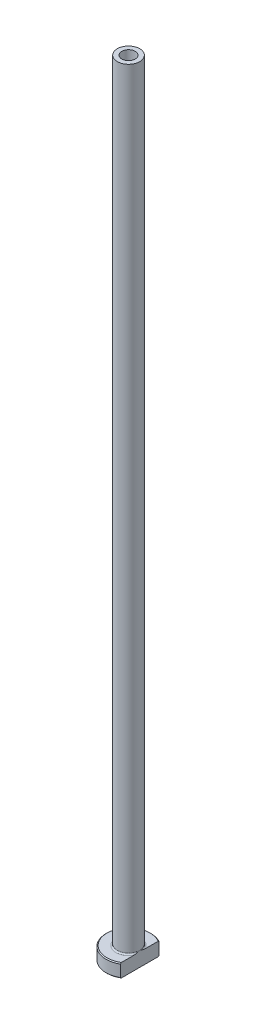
ISO-10303-21;
HEADER;
FILE_DESCRIPTION(('STEP AP214'),'2;1');
FILE_NAME('part.step','',(''),(''),'','','');
FILE_SCHEMA(('AUTOMOTIVE_DESIGN { 1 0 10303 214 1 1 1 1 }'));
ENDSEC;
DATA;
#1=APPLICATION_CONTEXT('core data for automotive mechanical design processes');
#2=APPLICATION_PROTOCOL_DEFINITION('international standard','automotive_design',2000,#1);
#3=PRODUCT_CONTEXT('',#1,'mechanical');
#4=PRODUCT('Part','Part','',(#3));
#5=PRODUCT_RELATED_PRODUCT_CATEGORY('part','',(#4));
#6=PRODUCT_DEFINITION_FORMATION('','',#4);
#7=PRODUCT_DEFINITION_CONTEXT('part definition',#1,'design');
#8=PRODUCT_DEFINITION('design','',#6,#7);
#9=PRODUCT_DEFINITION_SHAPE('','',#8);
#10=(LENGTH_UNIT() NAMED_UNIT(*) SI_UNIT(.MILLI.,.METRE.));
#11=(NAMED_UNIT(*) PLANE_ANGLE_UNIT() SI_UNIT($,.RADIAN.));
#12=(NAMED_UNIT(*) SI_UNIT($,.STERADIAN.) SOLID_ANGLE_UNIT());
#13=UNCERTAINTY_MEASURE_WITH_UNIT(LENGTH_MEASURE(1.E-05),#10,'distance_accuracy_value','');
#14=(GEOMETRIC_REPRESENTATION_CONTEXT(3) GLOBAL_UNCERTAINTY_ASSIGNED_CONTEXT((#13)) GLOBAL_UNIT_ASSIGNED_CONTEXT((#10,
#11,#12)) REPRESENTATION_CONTEXT('',''));
#15=CARTESIAN_POINT('',(0.,0.,0.));
#16=DIRECTION('',(0.,0.,1.));
#17=DIRECTION('',(1.,0.,0.));
#18=AXIS2_PLACEMENT_3D('',#15,#16,#17);
#19=CARTESIAN_POINT('',(0.,92.1876809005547,0.));
#20=DIRECTION('',(0.,1.,0.));
#21=DIRECTION('',(0.,0.,1.));
#22=AXIS2_PLACEMENT_3D('',#19,#20,#21);
#23=CYLINDRICAL_SURFACE('',#22,1.5);
#24=CARTESIAN_POINT('',(0.,175.,0.));
#25=DIRECTION('',(0.,1.,0.));
#26=DIRECTION('',(0.,0.,1.));
#27=AXIS2_PLACEMENT_3D('',#24,#25,#26);
#28=CIRCLE('',#27,1.5);
#29=CARTESIAN_POINT('',(0.,175.,1.5));
#30=VERTEX_POINT('',#29);
#31=EDGE_CURVE('E167',#30,#30,#28,.T.);
#32=ORIENTED_EDGE('',*,*,#31,.T.);
#33=EDGE_LOOP('',(#32));
#34=FACE_BOUND('',#33,.T.);
#35=CARTESIAN_POINT('',(0.,130.,0.));
#36=DIRECTION('',(0.,1.,0.));
#37=DIRECTION('',(0.,0.,1.));
#38=AXIS2_PLACEMENT_3D('',#35,#36,#37);
#39=CIRCLE('',#38,1.5);
#40=CARTESIAN_POINT('',(0.,130.,1.5));
#41=VERTEX_POINT('',#40);
#42=EDGE_CURVE('E170',#41,#41,#39,.T.);
#43=ORIENTED_EDGE('',*,*,#42,.F.);
#44=EDGE_LOOP('',(#43));
#45=FACE_BOUND('',#44,.T.);
#46=ADVANCED_FACE('F32',(#34,#45),#23,.F.);
#47=CARTESIAN_POINT('',(-1.5,175.,0.));
#48=DIRECTION('',(0.,1.,0.));
#49=DIRECTION('',(0.,0.,1.));
#50=AXIS2_PLACEMENT_3D('',#47,#48,#49);
#51=PLANE('',#50);
#52=CARTESIAN_POINT('',(0.,175.,0.));
#53=DIRECTION('',(0.,1.,0.));
#54=DIRECTION('',(0.,0.,1.));
#55=AXIS2_PLACEMENT_3D('',#52,#53,#54);
#56=CIRCLE('',#55,2.50000000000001);
#57=CARTESIAN_POINT('',(0.,175.,2.50000000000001));
#58=VERTEX_POINT('',#57);
#59=EDGE_CURVE('E174',#58,#58,#56,.T.);
#60=ORIENTED_EDGE('',*,*,#59,.T.);
#61=EDGE_LOOP('',(#60));
#62=FACE_BOUND('',#61,.T.);
#63=ORIENTED_EDGE('',*,*,#31,.F.);
#64=EDGE_LOOP('',(#63));
#65=FACE_BOUND('',#64,.T.);
#66=ADVANCED_FACE('F157',(#62,#65),#51,.T.);
#67=CARTESIAN_POINT('',(0.,92.1876809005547,0.));
#68=DIRECTION('',(0.,1.,0.));
#69=DIRECTION('',(0.,0.,1.));
#70=AXIS2_PLACEMENT_3D('',#67,#68,#69);
#71=CYLINDRICAL_SURFACE('',#70,2.5);
#72=CARTESIAN_POINT('',(0.,3.3,0.));
#73=DIRECTION('',(0.,1.,0.));
#74=DIRECTION('',(0.,0.,1.));
#75=AXIS2_PLACEMENT_3D('',#72,#73,#74);
#76=CIRCLE('',#75,2.5);
#77=CARTESIAN_POINT('',(2.5,3.3,0.));
#78=VERTEX_POINT('',#77);
#79=EDGE_CURVE('E180',#78,#78,#76,.T.);
#80=ORIENTED_EDGE('',*,*,#79,.T.);
#81=EDGE_LOOP('',(#80));
#82=FACE_BOUND('',#81,.T.);
#83=ORIENTED_EDGE('',*,*,#59,.F.);
#84=EDGE_LOOP('',(#83));
#85=FACE_BOUND('',#84,.T.);
#86=ADVANCED_FACE('F162',(#82,#85),#71,.T.);
#87=CARTESIAN_POINT('',(-2.49999999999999,3.,0.));
#88=DIRECTION('',(0.,1.,0.));
#89=DIRECTION('',(0.,0.,1.));
#90=AXIS2_PLACEMENT_3D('',#87,#88,#89);
#91=PLANE('',#90);
#92=DIRECTION('',(0.,0.,1.));
#93=VECTOR('',#92,1.);
#94=CARTESIAN_POINT('',(2.49999999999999,3.,0.));
#95=LINE('',#94,#93);
#96=CARTESIAN_POINT('',(2.5,3.,-4.09756024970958));
#97=VERTEX_POINT('',#96);
#98=CARTESIAN_POINT('',(2.49999999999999,3.,-1.26095202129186));
#99=VERTEX_POINT('',#98);
#100=EDGE_CURVE('E54',#97,#99,#95,.T.);
#101=ORIENTED_EDGE('',*,*,#100,.F.);
#102=CARTESIAN_POINT('',(0.,3.,0.));
#103=DIRECTION('',(0.,1.,0.));
#104=DIRECTION('',(0.,0.,1.));
#105=AXIS2_PLACEMENT_3D('',#102,#103,#104);
#106=CIRCLE('',#105,4.8);
#107=CARTESIAN_POINT('',(2.49999999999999,3.,4.09756024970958));
#108=VERTEX_POINT('',#107);
#109=EDGE_CURVE('E186',#97,#108,#106,.T.);
#110=ORIENTED_EDGE('',*,*,#109,.T.);
#111=CARTESIAN_POINT('',(2.49999999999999,3.,1.26095202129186));
#112=VERTEX_POINT('',#111);
#113=EDGE_CURVE('E134',#112,#108,#95,.T.);
#114=ORIENTED_EDGE('',*,*,#113,.F.);
#115=CARTESIAN_POINT('',(0.,3.,0.));
#116=DIRECTION('',(0.,1.,0.));
#117=DIRECTION('',(0.,0.,1.));
#118=AXIS2_PLACEMENT_3D('',#115,#116,#117);
#119=CIRCLE('',#118,2.8);
#120=EDGE_CURVE('E183',#112,#99,#119,.F.);
#121=ORIENTED_EDGE('',*,*,#120,.T.);
#122=EDGE_LOOP('',(#101,#110,#114,#121));
#123=FACE_BOUND('',#122,.T.);
#124=ADVANCED_FACE('F197',(#123),#91,.T.);
#125=CARTESIAN_POINT('',(0.,92.1876809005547,0.));
#126=DIRECTION('',(0.,1.,0.));
#127=DIRECTION('',(0.,0.,1.));
#128=AXIS2_PLACEMENT_3D('',#125,#126,#127);
#129=CYLINDRICAL_SURFACE('',#128,4.99999999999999);
#130=DIRECTION('',(0.,-1.,0.));
#131=VECTOR('',#130,1.);
#132=CARTESIAN_POINT('',(2.49999999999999,175.,4.33012701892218));
#133=LINE('',#132,#131);
#134=CARTESIAN_POINT('',(2.49999999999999,2.8,4.33012701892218));
#135=VERTEX_POINT('',#134);
#136=CARTESIAN_POINT('',(2.49999999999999,0.200000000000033,4.33012701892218));
#137=VERTEX_POINT('',#136);
#138=EDGE_CURVE('E82',#135,#137,#133,.T.);
#139=ORIENTED_EDGE('',*,*,#138,.F.);
#140=CARTESIAN_POINT('',(0.,2.8,0.));
#141=DIRECTION('',(0.,1.,0.));
#142=DIRECTION('',(0.,0.,1.));
#143=AXIS2_PLACEMENT_3D('',#140,#141,#142);
#144=CIRCLE('',#143,4.99999999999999);
#145=CARTESIAN_POINT('',(2.5,2.8,-4.33012701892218));
#146=VERTEX_POINT('',#145);
#147=EDGE_CURVE('E95',#135,#146,#144,.F.);
#148=ORIENTED_EDGE('',*,*,#147,.T.);
#149=DIRECTION('',(0.,-1.,0.));
#150=VECTOR('',#149,1.);
#151=CARTESIAN_POINT('',(2.5,175.,-4.33012701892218));
#152=LINE('',#151,#150);
#153=CARTESIAN_POINT('',(2.5,0.200000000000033,-4.33012701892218));
#154=VERTEX_POINT('',#153);
#155=EDGE_CURVE('E192',#146,#154,#152,.T.);
#156=ORIENTED_EDGE('',*,*,#155,.T.);
#157=CARTESIAN_POINT('',(0.,0.200000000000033,0.));
#158=DIRECTION('',(0.,-1.,0.));
#159=DIRECTION('',(0.,0.,-1.));
#160=AXIS2_PLACEMENT_3D('',#157,#158,#159);
#161=CIRCLE('',#160,4.99999999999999);
#162=EDGE_CURVE('E98',#154,#137,#161,.F.);
#163=ORIENTED_EDGE('',*,*,#162,.T.);
#164=EDGE_LOOP('',(#139,#148,#156,#163));
#165=FACE_BOUND('',#164,.T.);
#166=ADVANCED_FACE('F190',(#165),#129,.T.);
#167=CARTESIAN_POINT('',(-4.99999999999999,0.,0.));
#168=DIRECTION('',(0.,-1.,0.));
#169=DIRECTION('',(0.,0.,-1.));
#170=AXIS2_PLACEMENT_3D('',#167,#168,#169);
#171=PLANE('',#170);
#172=CARTESIAN_POINT('',(0.,0.,0.));
#173=DIRECTION('',(0.,-1.,0.));
#174=DIRECTION('',(0.,0.,-1.));
#175=AXIS2_PLACEMENT_3D('',#172,#173,#174);
#176=CIRCLE('',#175,2.24999999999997);
#177=CARTESIAN_POINT('',(0.,0.,-2.24999999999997));
#178=VERTEX_POINT('',#177);
#179=EDGE_CURVE('E40',#178,#178,#176,.F.);
#180=ORIENTED_EDGE('',*,*,#179,.T.);
#181=EDGE_LOOP('',(#180));
#182=FACE_BOUND('',#181,.T.);
#183=DIRECTION('',(0.,0.,-1.));
#184=VECTOR('',#183,1.);
#185=CARTESIAN_POINT('',(2.49999999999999,0.,4.33012701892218));
#186=LINE('',#185,#184);
#187=CARTESIAN_POINT('',(2.49999999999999,0.,4.09756024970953));
#188=VERTEX_POINT('',#187);
#189=CARTESIAN_POINT('',(2.5,0.,-4.09756024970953));
#190=VERTEX_POINT('',#189);
#191=EDGE_CURVE('E47',#188,#190,#186,.T.);
#192=ORIENTED_EDGE('',*,*,#191,.F.);
#193=CARTESIAN_POINT('',(0.,0.,0.));
#194=DIRECTION('',(0.,-1.,0.));
#195=DIRECTION('',(0.,0.,-1.));
#196=AXIS2_PLACEMENT_3D('',#193,#194,#195);
#197=CIRCLE('',#196,4.79999999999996);
#198=EDGE_CURVE('E92',#188,#190,#197,.T.);
#199=ORIENTED_EDGE('',*,*,#198,.T.);
#200=EDGE_LOOP('',(#192,#199));
#201=FACE_BOUND('',#200,.T.);
#202=ADVANCED_FACE('F91',(#182,#201),#171,.T.);
#203=CARTESIAN_POINT('',(0.,92.1876809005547,0.));
#204=DIRECTION('',(0.,1.,0.));
#205=DIRECTION('',(0.,0.,1.));
#206=AXIS2_PLACEMENT_3D('',#203,#204,#205);
#207=CYLINDRICAL_SURFACE('',#206,1.75);
#208=CARTESIAN_POINT('',(0.,0.499999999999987,0.));
#209=DIRECTION('',(0.,-1.,0.));
#210=DIRECTION('',(0.,0.,-1.));
#211=AXIS2_PLACEMENT_3D('',#208,#209,#210);
#212=CIRCLE('',#211,1.75);
#213=CARTESIAN_POINT('',(0.,0.499999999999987,-1.75));
#214=VERTEX_POINT('',#213);
#215=EDGE_CURVE('E11',#214,#214,#212,.T.);
#216=ORIENTED_EDGE('',*,*,#215,.T.);
#217=EDGE_LOOP('',(#216));
#218=FACE_BOUND('',#217,.T.);
#219=CARTESIAN_POINT('',(0.,118.,0.));
#220=DIRECTION('',(0.,1.,0.));
#221=DIRECTION('',(0.,0.,1.));
#222=AXIS2_PLACEMENT_3D('',#219,#220,#221);
#223=CIRCLE('',#222,1.75);
#224=CARTESIAN_POINT('',(0.,118.,1.75));
#225=VERTEX_POINT('',#224);
#226=EDGE_CURVE('E172',#225,#225,#223,.T.);
#227=ORIENTED_EDGE('',*,*,#226,.T.);
#228=EDGE_LOOP('',(#227));
#229=FACE_BOUND('',#228,.T.);
#230=ADVANCED_FACE('F215',(#218,#229),#207,.F.);
#231=CARTESIAN_POINT('',(0.,118.,0.));
#232=DIRECTION('',(0.,-1.,0.));
#233=DIRECTION('',(0.,0.,-1.));
#234=AXIS2_PLACEMENT_3D('',#231,#232,#233);
#235=CONICAL_SURFACE('',#234,1.75,0.0208303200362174);
#236=ORIENTED_EDGE('',*,*,#42,.T.);
#237=EDGE_LOOP('',(#236));
#238=FACE_BOUND('',#237,.T.);
#239=ORIENTED_EDGE('',*,*,#226,.F.);
#240=EDGE_LOOP('',(#239));
#241=FACE_BOUND('',#240,.T.);
#242=ADVANCED_FACE('F111',(#238,#241),#235,.F.);
#243=CARTESIAN_POINT('',(0.,3.3,0.));
#244=DIRECTION('',(0.,1.,0.));
#245=DIRECTION('',(0.,0.,1.));
#246=AXIS2_PLACEMENT_3D('',#243,#244,#245);
#247=TOROIDAL_SURFACE('',#246,2.8,0.3);
#248=ORIENTED_EDGE('',*,*,#120,.F.);
#249=CARTESIAN_POINT('',(2.5,3.3,0.));
#250=CARTESIAN_POINT('',(2.5,3.3000006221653,-4.84273808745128E-11));
#251=CARTESIAN_POINT('',(2.5,3.30000124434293,1.59621022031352E-07));
#252=CARTESIAN_POINT('',(2.5,3.30000243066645,6.45477892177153E-07));
#253=CARTESIAN_POINT('',(2.5,3.3000029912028,9.78480613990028E-07));
#254=CARTESIAN_POINT('',(2.5,3.3000041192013,1.77471968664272E-06));
#255=CARTESIAN_POINT('',(2.5,3.30000467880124,2.249021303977E-06));
#256=CARTESIAN_POINT('',(2.5,3.30000572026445,3.25953665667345E-06));
#257=CARTESIAN_POINT('',(2.5,3.30000620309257,3.79480728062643E-06));
#258=CARTESIAN_POINT('',(2.5,3.3000078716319,5.75794615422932E-06));
#259=CARTESIAN_POINT('',(2.5,3.30000896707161,7.2642410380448E-06));
#260=CARTESIAN_POINT('',(2.5,3.30001087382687,1.0336112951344E-05));
#261=CARTESIAN_POINT('',(2.5,3.30001169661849,1.18949499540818E-05));
#262=CARTESIAN_POINT('',(2.5,3.30001489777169,1.81400853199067E-05));
#263=CARTESIAN_POINT('',(2.5,3.300017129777,2.29062180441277E-05));
#264=CARTESIAN_POINT('',(2.5,3.30002067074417,3.21793870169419E-05));
#265=CARTESIAN_POINT('',(2.5,3.30002205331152,3.66588991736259E-05));
#266=CARTESIAN_POINT('',(2.5,3.30002810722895,5.61718409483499E-05));
#267=CARTESIAN_POINT('',(2.5,3.30003284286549,7.11735872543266E-05));
#268=CARTESIAN_POINT('',(2.49999999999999,3.30004025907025,9.89920336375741E-05));
#269=CARTESIAN_POINT('',(2.5,3.3000431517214,0.000111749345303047));
#270=CARTESIAN_POINT('',(2.5,3.30006652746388,0.000206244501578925));
#271=CARTESIAN_POINT('',(2.5,3.30009698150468,0.000285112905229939));
#272=CARTESIAN_POINT('',(2.49999999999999,3.30021213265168,0.000594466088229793));
#273=CARTESIAN_POINT('',(2.49999999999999,3.30028938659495,0.000826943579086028));
#274=CARTESIAN_POINT('',(2.5,3.30059681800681,0.0017388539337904));
#275=CARTESIAN_POINT('',(2.5,3.30083479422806,0.00241625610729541));
#276=CARTESIAN_POINT('',(2.49999999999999,3.30181198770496,0.00521069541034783));
#277=CARTESIAN_POINT('',(2.49999999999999,3.30254240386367,0.0073299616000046));
#278=CARTESIAN_POINT('',(2.5,3.31226043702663,0.0355096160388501));
#279=CARTESIAN_POINT('',(2.5,3.32130808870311,0.0615551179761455));
#280=CARTESIAN_POINT('',(2.49999999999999,3.33896212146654,0.112677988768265));
#281=CARTESIAN_POINT('',(2.49999999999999,3.34757212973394,0.137754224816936));
#282=CARTESIAN_POINT('',(2.5,3.36573068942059,0.190981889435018));
#283=CARTESIAN_POINT('',(2.5,3.37526654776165,0.219137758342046));
#284=CARTESIAN_POINT('',(2.5,3.39422867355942,0.275816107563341));
#285=CARTESIAN_POINT('',(2.5,3.40365272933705,0.304339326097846));
#286=CARTESIAN_POINT('',(2.5,3.42641697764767,0.374416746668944));
#287=CARTESIAN_POINT('',(2.5,3.43959811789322,0.416023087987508));
#288=CARTESIAN_POINT('',(2.5,3.46479157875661,0.49848190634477));
#289=CARTESIAN_POINT('',(2.5,3.47682455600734,0.539328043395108));
#290=CARTESIAN_POINT('',(2.5,3.50224427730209,0.629981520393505));
#291=CARTESIAN_POINT('',(2.5,3.51538048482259,0.679860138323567));
#292=CARTESIAN_POINT('',(2.5,3.53964074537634,0.7805117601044));
#293=CARTESIAN_POINT('',(2.5,3.55074877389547,0.831288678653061));
#294=CARTESIAN_POINT('',(2.5,3.57087054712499,0.937063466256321));
#295=CARTESIAN_POINT('',(2.5,3.57967623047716,0.992102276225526));
#296=CARTESIAN_POINT('',(2.5,3.59301148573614,1.10256024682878));
#297=CARTESIAN_POINT('',(2.5,3.59755297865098,1.15797790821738));
#298=CARTESIAN_POINT('',(2.5,3.60093314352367,1.26786705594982));
#299=CARTESIAN_POINT('',(2.5,3.59989366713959,1.32233291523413));
#300=CARTESIAN_POINT('',(2.5,3.59277279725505,1.40310062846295));
#301=CARTESIAN_POINT('',(2.5,3.58952137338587,1.42965222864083));
#302=CARTESIAN_POINT('',(2.5,3.58085857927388,1.48239078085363));
#303=CARTESIAN_POINT('',(2.5,3.57544928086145,1.50857805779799));
#304=CARTESIAN_POINT('',(2.5,3.56298810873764,1.55658799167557));
#305=CARTESIAN_POINT('',(2.5,3.5562820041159,1.5784990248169));
#306=CARTESIAN_POINT('',(2.5,3.5405539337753,1.62160292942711));
#307=CARTESIAN_POINT('',(2.5,3.5315222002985,1.64279233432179));
#308=CARTESIAN_POINT('',(2.5,3.51057199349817,1.68404469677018));
#309=CARTESIAN_POINT('',(2.5,3.49862012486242,1.70409105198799));
#310=CARTESIAN_POINT('',(2.5,3.47134074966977,1.74172093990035));
#311=CARTESIAN_POINT('',(2.5,3.45603127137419,1.75931683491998));
#312=CARTESIAN_POINT('',(2.5,3.42979930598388,1.78297070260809));
#313=CARTESIAN_POINT('',(2.5,3.42024268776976,1.79054141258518));
#314=CARTESIAN_POINT('',(2.5,3.40009035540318,1.80416997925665));
#315=CARTESIAN_POINT('',(2.5,3.3894949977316,1.81022835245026));
#316=CARTESIAN_POINT('',(2.5,3.36727740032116,1.82047087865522));
#317=CARTESIAN_POINT('',(2.5,3.3556453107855,1.82463409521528));
#318=CARTESIAN_POINT('',(2.5,3.33178837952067,1.83058442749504));
#319=CARTESIAN_POINT('',(2.5,3.31956435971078,1.83237474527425));
#320=CARTESIAN_POINT('',(2.5,3.29665736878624,1.83331852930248));
#321=CARTESIAN_POINT('',(2.5,3.2859867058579,1.83279233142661));
#322=CARTESIAN_POINT('',(2.5,3.26490749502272,1.82986307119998));
#323=CARTESIAN_POINT('',(2.5,3.25449899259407,1.82745968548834));
#324=CARTESIAN_POINT('',(2.5,3.23467098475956,1.82111257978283));
#325=CARTESIAN_POINT('',(2.5,3.22522816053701,1.81724026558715));
#326=CARTESIAN_POINT('',(2.5,3.20699535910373,1.80819497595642));
#327=CARTESIAN_POINT('',(2.5,3.19820556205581,1.80302164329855));
#328=CARTESIAN_POINT('',(2.5,3.17663162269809,1.78842115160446));
#329=CARTESIAN_POINT('',(2.5,3.16436228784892,1.7782329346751));
#330=CARTESIAN_POINT('',(2.5,3.14157828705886,1.75604629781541));
#331=CARTESIAN_POINT('',(2.5,3.13106906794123,1.74404246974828));
#332=CARTESIAN_POINT('',(2.5,3.10600520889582,1.71142114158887));
#333=CARTESIAN_POINT('',(2.5,3.09267476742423,1.68986887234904));
#334=CARTESIAN_POINT('',(2.5,3.06940323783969,1.64508572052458));
#335=CARTESIAN_POINT('',(2.5,3.05946314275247,1.62185434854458));
#336=CARTESIAN_POINT('',(2.5,3.03545750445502,1.55546754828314));
#337=CARTESIAN_POINT('',(2.5,3.02444022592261,1.51122187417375));
#338=CARTESIAN_POINT('',(2.5,3.00863926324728,1.4211977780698));
#339=CARTESIAN_POINT('',(2.5,3.00393876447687,1.37540689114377));
#340=CARTESIAN_POINT('',(2.5,2.9992421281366,1.28072198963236));
#341=CARTESIAN_POINT('',(2.5,2.99956098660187,1.23181420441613));
#342=CARTESIAN_POINT('',(2.5,3.00436098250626,1.13410944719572));
#343=CARTESIAN_POINT('',(2.5,3.00885327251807,1.0853131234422));
#344=CARTESIAN_POINT('',(2.5,3.02074191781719,0.990773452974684));
#345=CARTESIAN_POINT('',(2.5,3.02796792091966,0.94500781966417));
#346=CARTESIAN_POINT('',(2.5,3.04465555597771,0.854199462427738));
#347=CARTESIAN_POINT('',(2.5,3.05410250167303,0.809153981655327));
#348=CARTESIAN_POINT('',(2.5,3.07710029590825,0.709411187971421));
#349=CARTESIAN_POINT('',(2.5,3.09109633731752,0.654817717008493));
#350=CARTESIAN_POINT('',(2.5,3.12140740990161,0.54486362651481));
#351=CARTESIAN_POINT('',(2.49999999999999,3.13777040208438,0.489516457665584));
#352=CARTESIAN_POINT('',(2.5,3.16649540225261,0.396740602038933));
#353=CARTESIAN_POINT('',(2.5,3.17848130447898,0.359193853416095));
#354=CARTESIAN_POINT('',(2.49999999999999,3.20280507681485,0.284651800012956));
#355=CARTESIAN_POINT('',(2.49999999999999,3.21513791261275,0.247654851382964));
#356=CARTESIAN_POINT('',(2.5,3.23873713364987,0.177767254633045));
#357=CARTESIAN_POINT('',(2.5,3.24997409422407,0.144866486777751));
#358=CARTESIAN_POINT('',(2.49999999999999,3.27307149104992,0.0777985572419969));
#359=CARTESIAN_POINT('',(2.49999999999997,3.28493883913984,0.0436336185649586));
#360=CARTESIAN_POINT('',(2.5,3.29745794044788,0.0073287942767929));
#361=CARTESIAN_POINT('',(2.5,3.29818879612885,0.00520838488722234));
#362=CARTESIAN_POINT('',(2.49999999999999,3.29916610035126,0.00241367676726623));
#363=CARTESIAN_POINT('',(2.49999999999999,3.29940376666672,0.00173715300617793));
#364=CARTESIAN_POINT('',(2.5,3.29971082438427,0.000826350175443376));
#365=CARTESIAN_POINT('',(2.5,3.29978800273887,0.000594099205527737));
#366=CARTESIAN_POINT('',(2.49999999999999,3.299903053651,0.000285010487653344));
#367=CARTESIAN_POINT('',(2.49999999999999,3.2999334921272,0.000206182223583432));
#368=CARTESIAN_POINT('',(2.5,3.29995685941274,0.000111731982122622));
#369=CARTESIAN_POINT('',(2.5,3.29995975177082,9.89774327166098E-05));
#370=CARTESIAN_POINT('',(2.5,3.29996716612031,7.11651886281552E-05));
#371=CARTESIAN_POINT('',(2.5,3.29997189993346,5.61668096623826E-05));
#372=CARTESIAN_POINT('',(2.5,3.29997795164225,3.66576327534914E-05));
#373=CARTESIAN_POINT('',(2.5,3.2999793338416,3.21785244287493E-05));
#374=CARTESIAN_POINT('',(2.5,3.29998287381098,2.29061373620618E-05));
#375=CARTESIAN_POINT('',(2.5,3.2999851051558,1.81403659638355E-05));
#376=CARTESIAN_POINT('',(2.5,3.29998830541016,1.1895582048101E-05));
#377=CARTESIAN_POINT('',(2.5,3.29998912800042,1.03367760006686E-05));
#378=CARTESIAN_POINT('',(2.5,3.29999103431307,7.26492761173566E-06));
#379=CARTESIAN_POINT('',(2.5,3.29999212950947,5.75862257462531E-06));
#380=CARTESIAN_POINT('',(2.5,3.2999937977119,3.79542444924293E-06));
#381=CARTESIAN_POINT('',(2.5,3.29999428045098,3.26012738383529E-06));
#382=CARTESIAN_POINT('',(2.5,3.29999532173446,2.2495431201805E-06));
#383=CARTESIAN_POINT('',(2.5,3.29999588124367,1.77519875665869E-06));
#384=CARTESIAN_POINT('',(2.5,3.29999700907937,9.78856956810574E-07));
#385=CARTESIAN_POINT('',(2.5,3.29999756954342,6.45796946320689E-07));
#386=CARTESIAN_POINT('',(2.5,3.2999987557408,1.59799561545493E-07));
#387=CARTESIAN_POINT('',(2.5,3.29999937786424,4.84255823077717E-11));
#388=CARTESIAN_POINT('',(2.5,3.3,0.));
#389=B_SPLINE_CURVE_WITH_KNOTS('',3,(#249,#250,#251,#252,#253,#254,#255,#256,#257,#258,#259,
#260,#261,#262,#263,#264,#265,#266,#267,#268,#269,#270,#271,#272,#273,#274,#275,#276,#277,#278,
#279,#280,#281,#282,#283,#284,#285,#286,#287,#288,#289,#290,#291,#292,#293,#294,#295,#296,#297,
#298,#299,#300,#301,#302,#303,#304,#305,#306,#307,#308,#309,#310,#311,#312,#313,#314,#315,#316,
#317,#318,#319,#320,#321,#322,#323,#324,#325,#326,#327,#328,#329,#330,#331,#332,#333,#334,#335,
#336,#337,#338,#339,#340,#341,#342,#343,#344,#345,#346,#347,#348,#349,#350,#351,#352,#353,#354,
#355,#356,#357,#358,#359,#360,#361,#362,#363,#364,#365,#366,#367,#368,#369,#370,#371,#372,#373,
#374,#375,#376,#377,#378,#379,#380,#381,#382,#383,#384,#385,#386,#387,#388),.UNSPECIFIED.,.T.,
.F.,(4,2,2,2,2,2,2,2,2,2,2,2,2,2,2,2,2,2,2,2,2,2,2,2,2,2,2,2,2,2,2,2,2,2,2,2,2,2,2,2,2,2,2,2,2,
2,2,2,2,2,2,2,2,2,2,2,2,2,2,2,2,2,2,2,2,2,2,2,2,4),(0.,1.86789240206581E-06,
3.81549625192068E-06,6.00610486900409E-06,8.16652987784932E-06,1.37285591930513E-05,
1.90122173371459E-05,3.47597293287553E-05,4.88082622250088E-05,9.59978452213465E-05,
0.000135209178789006,0.000388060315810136,0.00112364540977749,0.0032767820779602,
0.0100024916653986,0.0927120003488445,0.172253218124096,0.261432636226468,0.351551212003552,
0.48247714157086,0.610212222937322,0.76491521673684,0.920792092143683,1.08787897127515,
1.25449733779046,1.41749285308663,1.49767530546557,1.57778095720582,1.6464248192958,
1.71536183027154,1.78512750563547,1.8545273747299,1.89099315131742,1.92744645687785,
1.96429324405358,2.00109025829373,2.0329710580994,2.06485735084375,2.09535926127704,
2.12586955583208,2.17344034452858,2.2211557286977,2.29675134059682,2.37236907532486,
2.50839721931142,2.64619971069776,2.79268284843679,2.93955855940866,3.07848421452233,
3.21651583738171,3.38554045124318,3.55865938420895,3.67689643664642,3.79388863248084,
3.89819085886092,4.00668323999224,4.01341261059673,4.01556295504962,4.01629782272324,
4.01655054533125,4.01658974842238,4.01663692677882,4.01665097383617,4.01666671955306,
4.01667200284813,4.01667756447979,4.01667972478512,4.01668191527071,4.01668386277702,
4.01668573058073),.UNSPECIFIED.);
#390=EDGE_CURVE('E126',#112,#78,#389,.T.);
#391=ORIENTED_EDGE('',*,*,#390,.T.);
#392=ORIENTED_EDGE('',*,*,#79,.F.);
#393=CARTESIAN_POINT('',(2.5,3.3,0.));
#394=CARTESIAN_POINT('',(2.5,3.2999993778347,4.84277324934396E-11));
#395=CARTESIAN_POINT('',(2.5,3.29999875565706,-1.596210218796E-07));
#396=CARTESIAN_POINT('',(2.5,3.29999756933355,-6.45477892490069E-07));
#397=CARTESIAN_POINT('',(2.5,3.2999970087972,-9.78480614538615E-07));
#398=CARTESIAN_POINT('',(2.5,3.2999958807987,-1.77471968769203E-06));
#399=CARTESIAN_POINT('',(2.5,3.29999532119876,-2.2490213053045E-06));
#400=CARTESIAN_POINT('',(2.5,3.29999427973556,-3.25953665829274E-06));
#401=CARTESIAN_POINT('',(2.5,3.29999379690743,-3.79480728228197E-06));
#402=CARTESIAN_POINT('',(2.5,3.2999921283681,-5.75794615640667E-06));
#403=CARTESIAN_POINT('',(2.5,3.29999103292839,-7.26424104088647E-06));
#404=CARTESIAN_POINT('',(2.5,3.29998912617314,-1.03361129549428E-05));
#405=CARTESIAN_POINT('',(2.5,3.29998830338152,-1.18949499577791E-05));
#406=CARTESIAN_POINT('',(2.5,3.29998510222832,-1.81400853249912E-05));
#407=CARTESIAN_POINT('',(2.5,3.29998287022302,-2.29062180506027E-05));
#408=CARTESIAN_POINT('',(2.5,3.29997932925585,-3.21793870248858E-05));
#409=CARTESIAN_POINT('',(2.5,3.2999779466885,-3.66588991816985E-05));
#410=CARTESIAN_POINT('',(2.5,3.29997189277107,-5.61718409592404E-05));
#411=CARTESIAN_POINT('',(2.5,3.29996715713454,-7.11735872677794E-05));
#412=CARTESIAN_POINT('',(2.5,3.29995974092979,-9.89920336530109E-05));
#413=CARTESIAN_POINT('',(2.5,3.29995684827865,-0.000111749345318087));
#414=CARTESIAN_POINT('',(2.49999999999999,3.29993347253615,-0.000206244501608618));
#415=CARTESIAN_POINT('',(2.49999999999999,3.29990301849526,-0.000285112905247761));
#416=CARTESIAN_POINT('',(2.5,3.29978786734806,-0.000594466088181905));
#417=CARTESIAN_POINT('',(2.5,3.29971061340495,-0.000826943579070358));
#418=CARTESIAN_POINT('',(2.49999999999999,3.29940318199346,-0.00173885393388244));
#419=CARTESIAN_POINT('',(2.49999999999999,3.29916520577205,-0.00241625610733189));
#420=CARTESIAN_POINT('',(2.5,3.29818801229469,-0.00521069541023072));
#421=CARTESIAN_POINT('',(2.5,3.29745759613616,-0.00732996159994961));
#422=CARTESIAN_POINT('',(2.49999999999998,3.28773956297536,-0.0355096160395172));
#423=CARTESIAN_POINT('',(2.49999999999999,3.27869191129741,-0.061555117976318));
#424=CARTESIAN_POINT('',(2.5,3.26103787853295,-0.112677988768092));
#425=CARTESIAN_POINT('',(2.5,3.25242787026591,-0.137754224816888));
#426=CARTESIAN_POINT('',(2.49999999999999,3.23426931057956,-0.190981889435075));
#427=CARTESIAN_POINT('',(2.49999999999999,3.22473345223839,-0.219137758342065));
#428=CARTESIAN_POINT('',(2.5,3.20577132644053,-0.275816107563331));
#429=CARTESIAN_POINT('',(2.5,3.19634727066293,-0.304339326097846));
#430=CARTESIAN_POINT('',(2.5,3.17358302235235,-0.374416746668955));
#431=CARTESIAN_POINT('',(2.5,3.16040188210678,-0.416023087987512));
#432=CARTESIAN_POINT('',(2.5,3.13520842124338,-0.498481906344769));
#433=CARTESIAN_POINT('',(2.5,3.12317544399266,-0.539328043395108));
#434=CARTESIAN_POINT('',(2.5,3.0977557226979,-0.629981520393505));
#435=CARTESIAN_POINT('',(2.5,3.0846195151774,-0.679860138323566));
#436=CARTESIAN_POINT('',(2.5,3.06035925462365,-0.780511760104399));
#437=CARTESIAN_POINT('',(2.5,3.04925122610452,-0.83128867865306));
#438=CARTESIAN_POINT('',(2.5,3.02912945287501,-0.93706346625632));
#439=CARTESIAN_POINT('',(2.5,3.02032376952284,-0.992102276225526));
#440=CARTESIAN_POINT('',(2.5,3.00698851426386,-1.10256024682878));
#441=CARTESIAN_POINT('',(2.5,3.00244702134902,-1.15797790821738));
#442=CARTESIAN_POINT('',(2.5,2.99906685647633,-1.26786705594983));
#443=CARTESIAN_POINT('',(2.5,3.00010633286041,-1.32233291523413));
#444=CARTESIAN_POINT('',(2.5,3.00722720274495,-1.40310062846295));
#445=CARTESIAN_POINT('',(2.5,3.01047862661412,-1.42965222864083));
#446=CARTESIAN_POINT('',(2.5,3.01914142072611,-1.48239078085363));
#447=CARTESIAN_POINT('',(2.5,3.02455071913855,-1.508578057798));
#448=CARTESIAN_POINT('',(2.5,3.03701189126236,-1.55658799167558));
#449=CARTESIAN_POINT('',(2.5,3.0437179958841,-1.57849902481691));
#450=CARTESIAN_POINT('',(2.5,3.0594460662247,-1.62160292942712));
#451=CARTESIAN_POINT('',(2.5,3.06847779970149,-1.64279233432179));
#452=CARTESIAN_POINT('',(2.5,3.08942800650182,-1.68404469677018));
#453=CARTESIAN_POINT('',(2.5,3.10137987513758,-1.70409105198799));
#454=CARTESIAN_POINT('',(2.5,3.12865925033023,-1.74172093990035));
#455=CARTESIAN_POINT('',(2.5,3.14396872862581,-1.75931683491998));
#456=CARTESIAN_POINT('',(2.5,3.17020069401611,-1.78297070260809));
#457=CARTESIAN_POINT('',(2.5,3.17975731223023,-1.79054141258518));
#458=CARTESIAN_POINT('',(2.5,3.19990964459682,-1.80416997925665));
#459=CARTESIAN_POINT('',(2.5,3.21050500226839,-1.81022835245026));
#460=CARTESIAN_POINT('',(2.5,3.23272259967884,-1.82047087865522));
#461=CARTESIAN_POINT('',(2.5,3.2443546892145,-1.82463409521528));
#462=CARTESIAN_POINT('',(2.5,3.26821162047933,-1.83058442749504));
#463=CARTESIAN_POINT('',(2.5,3.28043564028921,-1.83237474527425));
#464=CARTESIAN_POINT('',(2.5,3.30334263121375,-1.83331852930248));
#465=CARTESIAN_POINT('',(2.5,3.3140132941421,-1.83279233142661));
#466=CARTESIAN_POINT('',(2.5,3.33509250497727,-1.82986307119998));
#467=CARTESIAN_POINT('',(2.5,3.34550100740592,-1.82745968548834));
#468=CARTESIAN_POINT('',(2.5,3.36532901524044,-1.82111257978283));
#469=CARTESIAN_POINT('',(2.5,3.37477183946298,-1.81724026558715));
#470=CARTESIAN_POINT('',(2.5,3.39300464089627,-1.80819497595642));
#471=CARTESIAN_POINT('',(2.5,3.40179443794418,-1.80302164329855));
#472=CARTESIAN_POINT('',(2.5,3.4233683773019,-1.78842115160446));
#473=CARTESIAN_POINT('',(2.5,3.43563771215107,-1.7782329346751));
#474=CARTESIAN_POINT('',(2.5,3.45842171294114,-1.75604629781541));
#475=CARTESIAN_POINT('',(2.5,3.46893093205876,-1.74404246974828));
#476=CARTESIAN_POINT('',(2.5,3.49399479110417,-1.71142114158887));
#477=CARTESIAN_POINT('',(2.5,3.50732523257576,-1.68986887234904));
#478=CARTESIAN_POINT('',(2.5,3.53059676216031,-1.64508572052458));
#479=CARTESIAN_POINT('',(2.5,3.54053685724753,-1.62185434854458));
#480=CARTESIAN_POINT('',(2.5,3.56454249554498,-1.55546754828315));
#481=CARTESIAN_POINT('',(2.5,3.57555977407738,-1.51122187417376));
#482=CARTESIAN_POINT('',(2.5,3.59136073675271,-1.4211977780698));
#483=CARTESIAN_POINT('',(2.5,3.59606123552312,-1.37540689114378));
#484=CARTESIAN_POINT('',(2.5,3.6007578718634,-1.28072198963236));
#485=CARTESIAN_POINT('',(2.5,3.60043901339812,-1.23181420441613));
#486=CARTESIAN_POINT('',(2.5,3.59563901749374,-1.13410944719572));
#487=CARTESIAN_POINT('',(2.5,3.59114672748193,-1.08531312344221));
#488=CARTESIAN_POINT('',(2.5,3.57925808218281,-0.990773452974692));
#489=CARTESIAN_POINT('',(2.5,3.57203207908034,-0.945007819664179));
#490=CARTESIAN_POINT('',(2.5,3.55534444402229,-0.854199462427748));
#491=CARTESIAN_POINT('',(2.5,3.54589749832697,-0.809153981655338));
#492=CARTESIAN_POINT('',(2.5,3.52289970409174,-0.709411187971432));
#493=CARTESIAN_POINT('',(2.5,3.50890366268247,-0.654817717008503));
#494=CARTESIAN_POINT('',(2.5,3.47859259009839,-0.544863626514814));
#495=CARTESIAN_POINT('',(2.49999999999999,3.46222959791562,-0.489516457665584));
#496=CARTESIAN_POINT('',(2.5,3.43350459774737,-0.396740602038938));
#497=CARTESIAN_POINT('',(2.5,3.42151869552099,-0.359193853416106));
#498=CARTESIAN_POINT('',(2.49999999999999,3.39719492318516,-0.284651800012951));
#499=CARTESIAN_POINT('',(2.49999999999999,3.38486208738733,-0.247654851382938));
#500=CARTESIAN_POINT('',(2.5,3.36126286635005,-0.177767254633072));
#501=CARTESIAN_POINT('',(2.5,3.35002590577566,-0.144866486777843));
#502=CARTESIAN_POINT('',(2.49999999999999,3.32692850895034,-0.0777985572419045));
#503=CARTESIAN_POINT('',(2.49999999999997,3.31506116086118,-0.0436336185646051));
#504=CARTESIAN_POINT('',(2.5,3.30254205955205,-0.00732879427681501));
#505=CARTESIAN_POINT('',(2.5,3.30181120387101,-0.00520838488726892));
#506=CARTESIAN_POINT('',(2.49999999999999,3.30083389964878,-0.00241367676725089));
#507=CARTESIAN_POINT('',(2.49999999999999,3.30059623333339,-0.00173715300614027));
#508=CARTESIAN_POINT('',(2.5,3.30028917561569,-0.000826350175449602));
#509=CARTESIAN_POINT('',(2.5,3.30021199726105,-0.000594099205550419));
#510=CARTESIAN_POINT('',(2.49999999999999,3.30009694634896,-0.000285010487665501));
#511=CARTESIAN_POINT('',(2.49999999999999,3.30006650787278,-0.000206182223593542));
#512=CARTESIAN_POINT('',(2.5,3.30004314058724,-0.000111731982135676));
#513=CARTESIAN_POINT('',(2.5,3.30004024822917,-9.89774327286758E-05));
#514=CARTESIAN_POINT('',(2.5,3.30003283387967,-7.11651886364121E-05));
#515=CARTESIAN_POINT('',(2.5,3.30002810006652,-5.61668096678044E-05));
#516=CARTESIAN_POINT('',(2.5,3.30002204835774,-3.66576327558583E-05));
#517=CARTESIAN_POINT('',(2.5,3.30002066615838,-3.21785244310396E-05));
#518=CARTESIAN_POINT('',(2.5,3.300017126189,-2.29061373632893E-05));
#519=CARTESIAN_POINT('',(2.5,3.30001489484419,-1.81403659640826E-05));
#520=CARTESIAN_POINT('',(2.5,3.30001169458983,-1.18955820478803E-05));
#521=CARTESIAN_POINT('',(2.5,3.30001087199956,-1.03367760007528E-05));
#522=CARTESIAN_POINT('',(2.5,3.30000896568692,-7.26492761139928E-06));
#523=CARTESIAN_POINT('',(2.5,3.30000787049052,-5.75862257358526E-06));
#524=CARTESIAN_POINT('',(2.5,3.30000620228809,-3.79542444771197E-06));
#525=CARTESIAN_POINT('',(2.5,3.30000571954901,-3.26012738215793E-06));
#526=CARTESIAN_POINT('',(2.5,3.30000467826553,-2.24954311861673E-06));
#527=CARTESIAN_POINT('',(2.5,3.30000411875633,-1.77519875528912E-06));
#528=CARTESIAN_POINT('',(2.5,3.30000299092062,-9.78856955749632E-07));
#529=CARTESIAN_POINT('',(2.5,3.30000243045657,-6.45796945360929E-07));
#530=CARTESIAN_POINT('',(2.5,3.30000124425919,-1.59799560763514E-07));
#531=CARTESIAN_POINT('',(2.5,3.30000062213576,-4.8424932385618E-11));
#532=CARTESIAN_POINT('',(2.5,3.3,0.));
#533=B_SPLINE_CURVE_WITH_KNOTS('',3,(#393,#394,#395,#396,#397,#398,#399,#400,#401,#402,#403,
#404,#405,#406,#407,#408,#409,#410,#411,#412,#413,#414,#415,#416,#417,#418,#419,#420,#421,#422,
#423,#424,#425,#426,#427,#428,#429,#430,#431,#432,#433,#434,#435,#436,#437,#438,#439,#440,#441,
#442,#443,#444,#445,#446,#447,#448,#449,#450,#451,#452,#453,#454,#455,#456,#457,#458,#459,#460,
#461,#462,#463,#464,#465,#466,#467,#468,#469,#470,#471,#472,#473,#474,#475,#476,#477,#478,#479,
#480,#481,#482,#483,#484,#485,#486,#487,#488,#489,#490,#491,#492,#493,#494,#495,#496,#497,#498,
#499,#500,#501,#502,#503,#504,#505,#506,#507,#508,#509,#510,#511,#512,#513,#514,#515,#516,#517,
#518,#519,#520,#521,#522,#523,#524,#525,#526,#527,#528,#529,#530,#531,#532),.UNSPECIFIED.,.T.,
.F.,(4,2,2,2,2,2,2,2,2,2,2,2,2,2,2,2,2,2,2,2,2,2,2,2,2,2,2,2,2,2,2,2,2,2,2,2,2,2,2,2,2,2,2,2,2,
2,2,2,2,2,2,2,2,2,2,2,2,2,2,2,2,2,2,2,2,2,2,2,2,4),(0.,1.86789240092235E-06,
3.81549624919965E-06,6.0061048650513E-06,8.16652987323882E-06,1.37285591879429E-05,
1.90122173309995E-05,3.47597293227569E-05,4.88082622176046E-05,9.59978452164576E-05,
0.000135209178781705,0.000388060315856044,0.00112364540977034,0.00327678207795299,
0.0100024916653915,0.0927120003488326,0.172253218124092,0.261432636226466,0.35155121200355,
0.482477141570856,0.610212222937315,0.764915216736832,0.920792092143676,1.08787897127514,
1.25449733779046,1.41749285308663,1.49767530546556,1.57778095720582,1.64642481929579,
1.71536183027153,1.78512750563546,1.85452737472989,1.89099315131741,1.92744645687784,
1.96429324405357,2.00109025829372,2.03297105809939,2.06485735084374,2.09535926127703,
2.12586955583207,2.17344034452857,2.2211557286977,2.29675134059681,2.37236907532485,
2.50839721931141,2.64619971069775,2.79268284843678,2.93955855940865,3.07848421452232,
3.21651583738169,3.38554045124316,3.55865938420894,3.67689643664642,3.79388863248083,
3.89819085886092,4.00668323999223,4.01341261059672,4.01556295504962,4.01629782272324,
4.01655054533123,4.01658974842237,4.01663692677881,4.01665097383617,4.01666671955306,
4.01667200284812,4.01667756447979,4.01667972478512,4.01668191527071,4.01668386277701,
4.01668573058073),.UNSPECIFIED.);
#534=EDGE_CURVE('E135',#78,#99,#533,.T.);
#535=ORIENTED_EDGE('',*,*,#534,.T.);
#536=EDGE_LOOP('',(#248,#391,#392,#535));
#537=FACE_BOUND('',#536,.T.);
#538=ADVANCED_FACE('F141',(#537),#247,.F.);
#539=CARTESIAN_POINT('',(0.,3.,0.));
#540=DIRECTION('',(0.,-1.,0.));
#541=DIRECTION('',(0.,0.,-1.));
#542=AXIS2_PLACEMENT_3D('',#539,#540,#541);
#543=CONICAL_SURFACE('',#542,4.8,0.785398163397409);
#544=CARTESIAN_POINT('',(2.5,-2.05039133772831,-9.52786489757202));
#545=CARTESIAN_POINT('',(2.5,-1.84160367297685,-9.31199733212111));
#546=CARTESIAN_POINT('',(2.5,-1.63304008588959,-9.09591231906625));
#547=CARTESIAN_POINT('',(2.5,-1.21649358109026,-8.66317810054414));
#548=CARTESIAN_POINT('',(2.5,-1.00851067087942,-8.44652888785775));
#549=CARTESIAN_POINT('',(2.5,-0.593157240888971,-8.01243155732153));
#550=CARTESIAN_POINT('',(2.5,-0.385787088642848,-7.79498308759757));
#551=CARTESIAN_POINT('',(2.5,0.0280365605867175,-7.35921771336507));
#552=CARTESIAN_POINT('',(2.5,0.234490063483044,-7.14090081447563));
#553=CARTESIAN_POINT('',(2.5,0.642130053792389,-6.70748960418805));
#554=CARTESIAN_POINT('',(2.5,0.84333981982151,-6.49241720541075));
#555=CARTESIAN_POINT('',(2.5,1.24425381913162,-6.06087422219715));
#556=CARTESIAN_POINT('',(2.5,1.44395806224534,-5.84440364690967));
#557=CARTESIAN_POINT('',(2.5,1.84127751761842,-5.40963663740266));
#558=CARTESIAN_POINT('',(2.5,2.03889317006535,-5.19134060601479));
#559=CARTESIAN_POINT('',(2.5,2.43125043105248,-4.75218509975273));
#560=CARTESIAN_POINT('',(2.5,2.62599215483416,-4.53132572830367));
#561=CARTESIAN_POINT('',(2.5,2.93693788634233,-4.17181619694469));
#562=CARTESIAN_POINT('',(2.5,3.0544649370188,-4.03431188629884));
#563=CARTESIAN_POINT('',(2.5,3.28742704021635,-3.75751486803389));
#564=CARTESIAN_POINT('',(2.5,3.40286188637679,-3.61822198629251));
#565=CARTESIAN_POINT('',(2.5,3.63213234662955,-3.33586492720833));
#566=CARTESIAN_POINT('',(2.5,3.74593818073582,-3.19277645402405));
#567=CARTESIAN_POINT('',(2.5,3.96956266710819,-2.90356071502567));
#568=CARTESIAN_POINT('',(2.5,4.07938227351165,-2.75743418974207));
#569=CARTESIAN_POINT('',(2.5,4.29502410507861,-2.45881038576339));
#570=CARTESIAN_POINT('',(2.5,4.4007603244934,-2.30625006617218));
#571=CARTESIAN_POINT('',(2.5,4.55286945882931,-2.07299325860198));
#572=CARTESIAN_POINT('',(2.5,4.60252613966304,-1.99444197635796));
#573=CARTESIAN_POINT('',(2.5,4.69908164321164,-1.8356682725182));
#574=CARTESIAN_POINT('',(2.5,4.74598077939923,-1.75544604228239));
#575=CARTESIAN_POINT('',(2.5,4.83578466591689,-1.59405362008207));
#576=CARTESIAN_POINT('',(2.5,4.87873126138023,-1.51290702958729));
#577=CARTESIAN_POINT('',(2.5,4.96038600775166,-1.34852090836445));
#578=CARTESIAN_POINT('',(2.5,4.99909338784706,-1.26528100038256));
#579=CARTESIAN_POINT('',(2.5,5.1070309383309,-1.01251774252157));
#580=CARTESIAN_POINT('',(2.5,5.16843307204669,-0.83934206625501));
#581=CARTESIAN_POINT('',(2.5,5.23490554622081,-0.579703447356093));
#582=CARTESIAN_POINT('',(2.5,5.25253806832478,-0.496421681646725));
#583=CARTESIAN_POINT('',(2.5,5.2798633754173,-0.328535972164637));
#584=CARTESIAN_POINT('',(2.5,5.28955686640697,-0.243932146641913));
#585=CARTESIAN_POINT('',(2.5,5.30031768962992,-0.0744340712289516));
#586=CARTESIAN_POINT('',(2.5,5.30141176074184,0.0104584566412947));
#587=CARTESIAN_POINT('',(2.5,5.29496530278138,0.179916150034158));
#588=CARTESIAN_POINT('',(2.5,5.28742406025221,0.264481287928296));
#589=CARTESIAN_POINT('',(2.5,5.26433424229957,0.431754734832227));
#590=CARTESIAN_POINT('',(2.5,5.2488543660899,0.5144727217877));
#591=CARTESIAN_POINT('',(2.5,5.21085318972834,0.678257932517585));
#592=CARTESIAN_POINT('',(2.5,5.18833104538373,0.759324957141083));
#593=CARTESIAN_POINT('',(2.5,5.13718929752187,0.920001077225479));
#594=CARTESIAN_POINT('',(2.5,5.10853534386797,0.999599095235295));
#595=CARTESIAN_POINT('',(2.5,5.0462809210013,1.15679278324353));
#596=CARTESIAN_POINT('',(2.5,5.01268146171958,1.2343888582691));
#597=CARTESIAN_POINT('',(2.5,4.90558195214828,1.46503672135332));
#598=CARTESIAN_POINT('',(2.5,4.82601567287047,1.6152635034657));
#599=CARTESIAN_POINT('',(2.5,4.65635232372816,1.909707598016));
#600=CARTESIAN_POINT('',(2.49999999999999,4.56624199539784,2.0539170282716));
#601=CARTESIAN_POINT('',(2.49999999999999,4.37862201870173,2.33821627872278));
#602=CARTESIAN_POINT('',(2.49999999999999,4.28108460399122,2.47828761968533));
#603=CARTESIAN_POINT('',(2.49999999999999,4.08116271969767,2.75478641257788));
#604=CARTESIAN_POINT('',(2.49999999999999,3.97878070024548,2.89121565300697));
#605=CARTESIAN_POINT('',(2.49999999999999,3.76913910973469,3.16313520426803));
#606=CARTESIAN_POINT('',(2.49999999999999,3.66183307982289,3.29858952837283));
#607=CARTESIAN_POINT('',(2.49999999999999,3.44456217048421,3.56736427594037));
#608=CARTESIAN_POINT('',(2.49999999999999,3.33459700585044,3.70068446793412));
#609=CARTESIAN_POINT('',(2.49999999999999,3.11293465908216,3.96532340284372));
#610=CARTESIAN_POINT('',(2.49999999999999,3.00124232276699,4.0966462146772));
#611=CARTESIAN_POINT('',(2.49999999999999,2.77631276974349,4.35796341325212));
#612=CARTESIAN_POINT('',(2.49999999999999,2.66307552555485,4.48795777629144));
#613=CARTESIAN_POINT('',(2.49999999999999,2.36028773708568,4.83228553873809));
#614=CARTESIAN_POINT('',(2.49999999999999,2.16967435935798,5.04568363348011));
#615=CARTESIAN_POINT('',(2.49999999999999,1.78611780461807,5.47037913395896));
#616=CARTESIAN_POINT('',(2.49999999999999,1.59317456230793,5.68167648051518));
#617=CARTESIAN_POINT('',(2.49999999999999,1.20540648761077,6.10290357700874));
#618=CARTESIAN_POINT('',(2.49999999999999,1.01058005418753,6.3128318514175));
#619=CARTESIAN_POINT('',(2.49999999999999,0.619649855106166,6.73149551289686));
#620=CARTESIAN_POINT('',(2.49999999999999,0.423546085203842,6.94023089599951));
#621=CARTESIAN_POINT('',(2.49999999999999,0.0384434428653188,7.3482039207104));
#622=CARTESIAN_POINT('',(2.49999999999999,-0.150515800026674,7.54747899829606));
#623=CARTESIAN_POINT('',(2.49999999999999,-0.529153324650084,7.94534601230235));
#624=CARTESIAN_POINT('',(2.49999999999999,-0.7188316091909,8.14393794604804));
#625=CARTESIAN_POINT('',(2.49999999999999,-1.09855461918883,8.54034636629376));
#626=CARTESIAN_POINT('',(2.49999999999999,-1.28859869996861,8.73816347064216));
#627=CARTESIAN_POINT('',(2.49999999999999,-1.66916268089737,9.13333639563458));
#628=CARTESIAN_POINT('',(2.49999999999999,-1.85968257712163,9.33069222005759));
#629=CARTESIAN_POINT('',(2.49999999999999,-2.0503913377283,9.52786489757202));
#630=B_SPLINE_CURVE_WITH_KNOTS('',3,(#544,#545,#546,#547,#548,#549,#550,#551,#552,#553,#554,
#555,#556,#557,#558,#559,#560,#561,#562,#563,#564,#565,#566,#567,#568,#569,#570,#571,#572,#573,
#574,#575,#576,#577,#578,#579,#580,#581,#582,#583,#584,#585,#586,#587,#588,#589,#590,#591,#592,
#593,#594,#595,#596,#597,#598,#599,#600,#601,#602,#603,#604,#605,#606,#607,#608,#609,#610,#611,
#612,#613,#614,#615,#616,#617,#618,#619,#620,#621,#622,#623,#624,#625,#626,#627,#628,#629),
.UNSPECIFIED.,.F.,.F.,(4,2,2,2,2,2,2,2,2,2,2,2,2,2,2,2,2,2,2,2,2,2,2,2,2,2,2,2,2,2,2,2,2,2,2,2,
2,2,2,2,2,2,4),(0.,0.900955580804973,1.80192274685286,2.70335062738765,3.60477268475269,
4.48832484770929,5.37187123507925,6.25522753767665,7.13854832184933,7.68119321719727,
8.22389134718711,8.7723229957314,9.32062249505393,9.87724663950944,10.1559936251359,
10.4347088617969,10.7100145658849,10.98537024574,11.5339745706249,11.7890461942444,
12.0440951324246,12.2983507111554,12.5526272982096,12.8047396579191,13.0568822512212,
13.3104761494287,13.5640183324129,14.0732618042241,14.5831526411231,15.0950533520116,
15.6066978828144,16.1250759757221,16.6435099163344,17.1606868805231,17.6778730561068,
18.5362451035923,19.3946412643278,20.2538459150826,21.1130534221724,21.9369112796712,
22.7607723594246,23.5837145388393,24.4066499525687),.UNSPECIFIED.);
#631=EDGE_CURVE('E133',#146,#97,#630,.T.);
#632=ORIENTED_EDGE('',*,*,#631,.F.);
#633=ORIENTED_EDGE('',*,*,#147,.F.);
#634=EDGE_CURVE('E118',#108,#135,#630,.T.);
#635=ORIENTED_EDGE('',*,*,#634,.F.);
#636=ORIENTED_EDGE('',*,*,#109,.F.);
#637=EDGE_LOOP('',(#632,#633,#635,#636));
#638=FACE_BOUND('',#637,.T.);
#639=ADVANCED_FACE('F145',(#638),#543,.T.);
#640=CARTESIAN_POINT('',(0.,0.200000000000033,0.));
#641=DIRECTION('',(0.,1.,0.));
#642=DIRECTION('',(0.,0.,1.));
#643=AXIS2_PLACEMENT_3D('',#640,#641,#642);
#644=CONICAL_SURFACE('',#643,4.99999999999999,0.785398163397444);
#645=CARTESIAN_POINT('',(2.49999999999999,5.050391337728,9.52786489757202));
#646=CARTESIAN_POINT('',(2.49999999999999,4.84160367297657,9.31199733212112));
#647=CARTESIAN_POINT('',(2.49999999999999,4.63304008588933,9.09591231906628));
#648=CARTESIAN_POINT('',(2.49999999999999,4.21649358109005,8.66317810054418));
#649=CARTESIAN_POINT('',(2.49999999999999,4.00851067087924,8.44652888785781));
#650=CARTESIAN_POINT('',(2.49999999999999,3.59315724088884,8.01243155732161));
#651=CARTESIAN_POINT('',(2.49999999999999,3.38578708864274,7.79498308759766));
#652=CARTESIAN_POINT('',(2.49999999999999,2.97196343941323,7.35921771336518));
#653=CARTESIAN_POINT('',(2.49999999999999,2.76550993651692,7.14090081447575));
#654=CARTESIAN_POINT('',(2.49999999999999,2.35786994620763,6.70748960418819));
#655=CARTESIAN_POINT('',(2.49999999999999,2.15666018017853,6.4924172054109));
#656=CARTESIAN_POINT('',(2.49999999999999,1.75574618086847,6.06087422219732));
#657=CARTESIAN_POINT('',(2.49999999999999,1.55604193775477,5.84440364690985));
#658=CARTESIAN_POINT('',(2.49999999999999,1.15872248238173,5.40963663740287));
#659=CARTESIAN_POINT('',(2.49999999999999,0.961106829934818,5.191340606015));
#660=CARTESIAN_POINT('',(2.49999999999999,0.568749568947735,4.75218509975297));
#661=CARTESIAN_POINT('',(2.49999999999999,0.374007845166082,4.53132572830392));
#662=CARTESIAN_POINT('',(2.49999999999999,0.0630621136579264,4.17181619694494));
#663=CARTESIAN_POINT('',(2.49999999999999,-0.0544649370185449,4.03431188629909));
#664=CARTESIAN_POINT('',(2.49999999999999,-0.287427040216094,3.75751486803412));
#665=CARTESIAN_POINT('',(2.49999999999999,-0.402861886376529,3.61822198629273));
#666=CARTESIAN_POINT('',(2.49999999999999,-0.632132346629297,3.33586492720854));
#667=CARTESIAN_POINT('',(2.49999999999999,-0.745938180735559,3.19277645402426));
#668=CARTESIAN_POINT('',(2.49999999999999,-0.969562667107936,2.90356071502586));
#669=CARTESIAN_POINT('',(2.49999999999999,-1.0793822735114,2.75743418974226));
#670=CARTESIAN_POINT('',(2.49999999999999,-1.29502410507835,2.45881038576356));
#671=CARTESIAN_POINT('',(2.5,-1.40076032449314,2.30625006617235));
#672=CARTESIAN_POINT('',(2.5,-1.55286945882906,2.07299325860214));
#673=CARTESIAN_POINT('',(2.5,-1.60252613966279,1.99444197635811));
#674=CARTESIAN_POINT('',(2.5,-1.69908164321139,1.83566827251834));
#675=CARTESIAN_POINT('',(2.5,-1.74598077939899,1.75544604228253));
#676=CARTESIAN_POINT('',(2.5,-1.83578466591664,1.59405362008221));
#677=CARTESIAN_POINT('',(2.5,-1.87873126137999,1.51290702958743));
#678=CARTESIAN_POINT('',(2.5,-1.96038600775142,1.34852090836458));
#679=CARTESIAN_POINT('',(2.5,-1.99909338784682,1.26528100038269));
#680=CARTESIAN_POINT('',(2.5,-2.10703093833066,1.0125177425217));
#681=CARTESIAN_POINT('',(2.5,-2.16843307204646,0.839342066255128));
#682=CARTESIAN_POINT('',(2.5,-2.23490554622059,0.579703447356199));
#683=CARTESIAN_POINT('',(2.5,-2.25253806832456,0.496421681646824));
#684=CARTESIAN_POINT('',(2.5,-2.27986337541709,0.328535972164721));
#685=CARTESIAN_POINT('',(2.5,-2.28955686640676,0.243932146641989));
#686=CARTESIAN_POINT('',(2.5,-2.30031768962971,0.0744340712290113));
#687=CARTESIAN_POINT('',(2.5,-2.30141176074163,-0.0104584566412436));
#688=CARTESIAN_POINT('',(2.5,-2.29496530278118,-0.179916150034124));
#689=CARTESIAN_POINT('',(2.5,-2.28742406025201,-0.26448128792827));
#690=CARTESIAN_POINT('',(2.5,-2.26433424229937,-0.431754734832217));
#691=CARTESIAN_POINT('',(2.5,-2.2488543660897,-0.514472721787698));
#692=CARTESIAN_POINT('',(2.5,-2.21085318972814,-0.6782579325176));
#693=CARTESIAN_POINT('',(2.5,-2.18833104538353,-0.759324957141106));
#694=CARTESIAN_POINT('',(2.5,-2.13718929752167,-0.920001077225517));
#695=CARTESIAN_POINT('',(2.5,-2.10853534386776,-0.999599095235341));
#696=CARTESIAN_POINT('',(2.5,-2.04628092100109,-1.15679278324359));
#697=CARTESIAN_POINT('',(2.5,-2.01268146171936,-1.23438885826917));
#698=CARTESIAN_POINT('',(2.5,-1.90558195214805,-1.46503672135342));
#699=CARTESIAN_POINT('',(2.5,-1.82601567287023,-1.61526350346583));
#700=CARTESIAN_POINT('',(2.5,-1.65635232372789,-1.90970759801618));
#701=CARTESIAN_POINT('',(2.5,-1.56624199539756,-2.0539170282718));
#702=CARTESIAN_POINT('',(2.5,-1.37862201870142,-2.33821627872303));
#703=CARTESIAN_POINT('',(2.5,-1.28108460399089,-2.4782876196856));
#704=CARTESIAN_POINT('',(2.5,-1.08116271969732,-2.7547864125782));
#705=CARTESIAN_POINT('',(2.5,-0.978780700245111,-2.89121565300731));
#706=CARTESIAN_POINT('',(2.5,-0.769139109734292,-3.16313520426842));
#707=CARTESIAN_POINT('',(2.5,-0.661833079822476,-3.29858952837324));
#708=CARTESIAN_POINT('',(2.5,-0.444562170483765,-3.56736427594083));
#709=CARTESIAN_POINT('',(2.5,-0.334597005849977,-3.7006844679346));
#710=CARTESIAN_POINT('',(2.5,-0.112934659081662,-3.96532340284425));
#711=CARTESIAN_POINT('',(2.5,-0.00124232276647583,-4.09664621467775));
#712=CARTESIAN_POINT('',(2.5,0.223687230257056,-4.35796341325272));
#713=CARTESIAN_POINT('',(2.5,0.336924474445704,-4.48795777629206));
#714=CARTESIAN_POINT('',(2.5,0.639712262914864,-4.8322855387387));
#715=CARTESIAN_POINT('',(2.5,0.830325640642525,-5.04568363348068));
#716=CARTESIAN_POINT('',(2.5,1.21388219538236,-5.47037913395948));
#717=CARTESIAN_POINT('',(2.5,1.40682543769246,-5.68167648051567));
#718=CARTESIAN_POINT('',(2.5,1.79459351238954,-6.10290357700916));
#719=CARTESIAN_POINT('',(2.5,1.98941994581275,-6.3128318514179));
#720=CARTESIAN_POINT('',(2.5,2.38035014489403,-6.7314955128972));
#721=CARTESIAN_POINT('',(2.5,2.57645391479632,-6.94023089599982));
#722=CARTESIAN_POINT('',(2.5,2.96155655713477,-7.34820392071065));
#723=CARTESIAN_POINT('',(2.5,3.15051580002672,-7.54747899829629));
#724=CARTESIAN_POINT('',(2.5,3.52915332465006,-7.94534601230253));
#725=CARTESIAN_POINT('',(2.5,3.71883160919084,-8.14393794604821));
#726=CARTESIAN_POINT('',(2.5,4.0985546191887,-8.54034636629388));
#727=CARTESIAN_POINT('',(2.5,4.28859869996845,-8.73816347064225));
#728=CARTESIAN_POINT('',(2.5,4.66916268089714,-9.13333639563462));
#729=CARTESIAN_POINT('',(2.5,4.85968257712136,-9.33069222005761));
#730=CARTESIAN_POINT('',(2.5,5.050391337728,-9.52786489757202));
#731=B_SPLINE_CURVE_WITH_KNOTS('',3,(#645,#646,#647,#648,#649,#650,#651,#652,#653,#654,#655,
#656,#657,#658,#659,#660,#661,#662,#663,#664,#665,#666,#667,#668,#669,#670,#671,#672,#673,#674,
#675,#676,#677,#678,#679,#680,#681,#682,#683,#684,#685,#686,#687,#688,#689,#690,#691,#692,#693,
#694,#695,#696,#697,#698,#699,#700,#701,#702,#703,#704,#705,#706,#707,#708,#709,#710,#711,#712,
#713,#714,#715,#716,#717,#718,#719,#720,#721,#722,#723,#724,#725,#726,#727,#728,#729,#730),
.UNSPECIFIED.,.F.,.F.,(4,2,2,2,2,2,2,2,2,2,2,2,2,2,2,2,2,2,2,2,2,2,2,2,2,2,2,2,2,2,2,2,2,2,2,2,
2,2,2,2,2,2,4),(0.,0.900955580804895,1.8019227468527,2.70335062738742,3.60477268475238,
4.48832484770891,5.37187123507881,6.25522753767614,7.13854832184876,7.68119321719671,
8.22389134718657,8.77232299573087,9.32062249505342,9.87724663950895,10.1559936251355,
10.4347088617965,10.7100145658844,10.9853702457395,11.5339745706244,11.789046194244,
12.0440951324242,12.298350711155,12.5526272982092,12.8047396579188,13.0568822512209,
13.3104761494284,13.5640183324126,14.0732618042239,14.583152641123,15.0950533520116,
15.6066978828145,16.1250759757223,16.6435099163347,17.1606868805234,17.6778730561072,
18.5362451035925,19.3946412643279,20.2538459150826,21.1130534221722,21.9369112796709,
22.7607723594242,23.5837145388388,24.4066499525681),.UNSPECIFIED.);
#732=EDGE_CURVE('E79',#137,#188,#731,.T.);
#733=ORIENTED_EDGE('',*,*,#732,.F.);
#734=ORIENTED_EDGE('',*,*,#162,.F.);
#735=EDGE_CURVE('E87',#190,#154,#731,.T.);
#736=ORIENTED_EDGE('',*,*,#735,.F.);
#737=ORIENTED_EDGE('',*,*,#198,.F.);
#738=EDGE_LOOP('',(#733,#734,#736,#737));
#739=FACE_BOUND('',#738,.T.);
#740=ADVANCED_FACE('F94',(#739),#644,.T.);
#741=CARTESIAN_POINT('',(2.49999999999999,175.,4.33012701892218));
#742=DIRECTION('',(-1.,0.,0.));
#743=DIRECTION('',(0.,0.,1.));
#744=AXIS2_PLACEMENT_3D('',#741,#742,#743);
#745=PLANE('',#744);
#746=ORIENTED_EDGE('',*,*,#390,.F.);
#747=ORIENTED_EDGE('',*,*,#113,.T.);
#748=ORIENTED_EDGE('',*,*,#634,.T.);
#749=ORIENTED_EDGE('',*,*,#138,.T.);
#750=ORIENTED_EDGE('',*,*,#732,.T.);
#751=ORIENTED_EDGE('',*,*,#191,.T.);
#752=ORIENTED_EDGE('',*,*,#735,.T.);
#753=ORIENTED_EDGE('',*,*,#155,.F.);
#754=ORIENTED_EDGE('',*,*,#631,.T.);
#755=ORIENTED_EDGE('',*,*,#100,.T.);
#756=ORIENTED_EDGE('',*,*,#534,.F.);
#757=EDGE_LOOP('',(#746,#747,#748,#749,#750,#751,#752,#753,#754,#755,#756));
#758=FACE_BOUND('',#757,.T.);
#759=ADVANCED_FACE('F80',(#758),#745,.F.);
#760=CARTESIAN_POINT('',(0.,0.,0.));
#761=DIRECTION('',(0.,-1.,0.));
#762=DIRECTION('',(0.,0.,-1.));
#763=AXIS2_PLACEMENT_3D('',#760,#761,#762);
#764=CONICAL_SURFACE('',#763,2.24999999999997,0.785398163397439);
#765=ORIENTED_EDGE('',*,*,#215,.F.);
#766=EDGE_LOOP('',(#765));
#767=FACE_BOUND('',#766,.T.);
#768=ORIENTED_EDGE('',*,*,#179,.F.);
#769=EDGE_LOOP('',(#768));
#770=FACE_BOUND('',#769,.T.);
#771=ADVANCED_FACE('F34',(#767,#770),#764,.F.);
#772=CLOSED_SHELL('',(#46,#66,#86,#124,#166,#202,#230,#242,#538,#639,#740,#759,#771));
#773=MANIFOLD_SOLID_BREP('B2',#772);
#774=ADVANCED_BREP_SHAPE_REPRESENTATION('',(#18,#773),#14);
#775=SHAPE_DEFINITION_REPRESENTATION(#9,#774);
ENDSEC;
END-ISO-10303-21;
